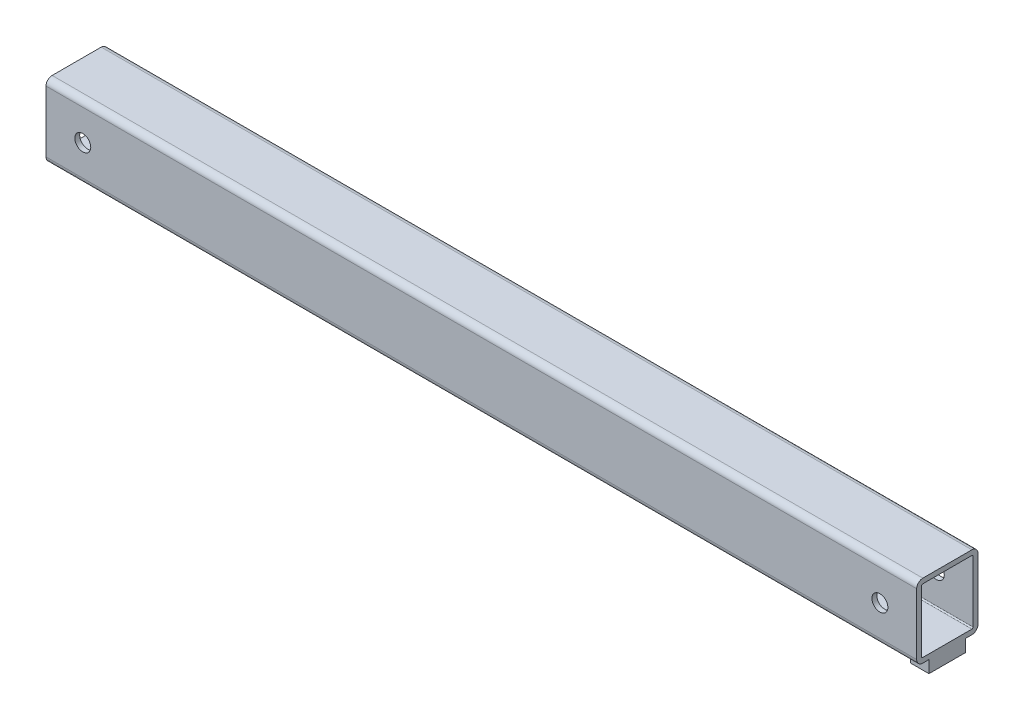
ISO-10303-21;
HEADER;
FILE_DESCRIPTION(('STEP AP214'),'2;1');
FILE_NAME('part.step','',(''),(''),'','','');
FILE_SCHEMA(('AUTOMOTIVE_DESIGN { 1 0 10303 214 1 1 1 1 }'));
ENDSEC;
DATA;
#1=APPLICATION_CONTEXT('core data for automotive mechanical design processes');
#2=APPLICATION_PROTOCOL_DEFINITION('international standard','automotive_design',2000,#1);
#3=PRODUCT_CONTEXT('',#1,'mechanical');
#4=PRODUCT('Part','Part','',(#3));
#5=PRODUCT_RELATED_PRODUCT_CATEGORY('part','',(#4));
#6=PRODUCT_DEFINITION_FORMATION('','',#4);
#7=PRODUCT_DEFINITION_CONTEXT('part definition',#1,'design');
#8=PRODUCT_DEFINITION('design','',#6,#7);
#9=PRODUCT_DEFINITION_SHAPE('','',#8);
#10=(LENGTH_UNIT() NAMED_UNIT(*) SI_UNIT(.MILLI.,.METRE.));
#11=(NAMED_UNIT(*) PLANE_ANGLE_UNIT() SI_UNIT($,.RADIAN.));
#12=(NAMED_UNIT(*) SI_UNIT($,.STERADIAN.) SOLID_ANGLE_UNIT());
#13=UNCERTAINTY_MEASURE_WITH_UNIT(LENGTH_MEASURE(1.E-05),#10,'distance_accuracy_value','');
#14=(GEOMETRIC_REPRESENTATION_CONTEXT(3) GLOBAL_UNCERTAINTY_ASSIGNED_CONTEXT((#13)) GLOBAL_UNIT_ASSIGNED_CONTEXT((#10,
#11,#12)) REPRESENTATION_CONTEXT('',''));
#15=CARTESIAN_POINT('',(0.,0.,0.));
#16=DIRECTION('',(0.,0.,1.));
#17=DIRECTION('',(1.,0.,0.));
#18=AXIS2_PLACEMENT_3D('',#15,#16,#17);
#19=CARTESIAN_POINT('',(680.,-25.0000000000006,-20.));
#20=DIRECTION('',(-1.,0.,0.));
#21=DIRECTION('',(0.,0.,1.));
#22=AXIS2_PLACEMENT_3D('',#19,#20,#21);
#23=CYLINDRICAL_SURFACE('',#22,1.);
#24=CARTESIAN_POINT('',(-29.9999999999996,-25.0000000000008,-20.));
#25=DIRECTION('',(-1.,0.,0.));
#26=DIRECTION('',(0.,0.,1.));
#27=AXIS2_PLACEMENT_3D('',#24,#25,#26);
#28=CIRCLE('',#27,1.);
#29=CARTESIAN_POINT('',(-30.,-26.0000000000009,-20.));
#30=VERTEX_POINT('',#29);
#31=CARTESIAN_POINT('',(-29.9999999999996,-25.0000000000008,-21.));
#32=VERTEX_POINT('',#31);
#33=EDGE_CURVE('E136',#30,#32,#28,.F.);
#34=ORIENTED_EDGE('',*,*,#33,.F.);
#35=DIRECTION('',(1.,0.,0.));
#36=VECTOR('',#35,1.);
#37=CARTESIAN_POINT('',(680.,-26.0000000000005,-19.9999999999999));
#38=LINE('',#37,#36);
#39=CARTESIAN_POINT('',(680.,-26.0000000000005,-20.));
#40=VERTEX_POINT('',#39);
#41=EDGE_CURVE('E138',#40,#30,#38,.F.);
#42=ORIENTED_EDGE('',*,*,#41,.F.);
#43=CARTESIAN_POINT('',(680.,-25.0000000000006,-20.));
#44=DIRECTION('',(-1.,0.,0.));
#45=DIRECTION('',(0.,0.,1.));
#46=AXIS2_PLACEMENT_3D('',#43,#44,#45);
#47=CIRCLE('',#46,1.);
#48=CARTESIAN_POINT('',(680.,-25.0000000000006,-21.));
#49=VERTEX_POINT('',#48);
#50=EDGE_CURVE('E19',#49,#40,#47,.T.);
#51=ORIENTED_EDGE('',*,*,#50,.F.);
#52=DIRECTION('',(1.,0.,0.));
#53=VECTOR('',#52,1.);
#54=CARTESIAN_POINT('',(680.,-25.0000000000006,-21.));
#55=LINE('',#54,#53);
#56=EDGE_CURVE('E143',#32,#49,#55,.T.);
#57=ORIENTED_EDGE('',*,*,#56,.F.);
#58=EDGE_LOOP('',(#34,#42,#51,#57));
#59=FACE_BOUND('',#58,.T.);
#60=ADVANCED_FACE('F15',(#59),#23,.F.);
#61=CARTESIAN_POINT('',(680.,-25.0000000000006,20.));
#62=DIRECTION('',(-1.,0.,0.));
#63=DIRECTION('',(0.,0.,1.));
#64=AXIS2_PLACEMENT_3D('',#61,#62,#63);
#65=CYLINDRICAL_SURFACE('',#64,1.);
#66=CARTESIAN_POINT('',(-29.9999999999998,-25.0000000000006,20.));
#67=DIRECTION('',(-1.,0.,0.));
#68=DIRECTION('',(0.,0.,1.));
#69=AXIS2_PLACEMENT_3D('',#66,#67,#68);
#70=CIRCLE('',#69,1.);
#71=CARTESIAN_POINT('',(-29.9999999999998,-25.0000000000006,21.));
#72=VERTEX_POINT('',#71);
#73=CARTESIAN_POINT('',(-30.,-26.0000000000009,20.));
#74=VERTEX_POINT('',#73);
#75=EDGE_CURVE('E337',#72,#74,#70,.F.);
#76=ORIENTED_EDGE('',*,*,#75,.F.);
#77=DIRECTION('',(1.,0.,0.));
#78=VECTOR('',#77,1.);
#79=CARTESIAN_POINT('',(680.,-25.0000000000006,21.));
#80=LINE('',#79,#78);
#81=CARTESIAN_POINT('',(680.,-25.0000000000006,21.));
#82=VERTEX_POINT('',#81);
#83=EDGE_CURVE('E232',#82,#72,#80,.F.);
#84=ORIENTED_EDGE('',*,*,#83,.F.);
#85=CARTESIAN_POINT('',(680.,-25.0000000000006,20.));
#86=DIRECTION('',(-1.,0.,0.));
#87=DIRECTION('',(0.,0.,1.));
#88=AXIS2_PLACEMENT_3D('',#85,#86,#87);
#89=CIRCLE('',#88,1.);
#90=CARTESIAN_POINT('',(680.,-26.0000000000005,20.));
#91=VERTEX_POINT('',#90);
#92=EDGE_CURVE('E339',#91,#82,#89,.T.);
#93=ORIENTED_EDGE('',*,*,#92,.F.);
#94=DIRECTION('',(1.,0.,0.));
#95=VECTOR('',#94,1.);
#96=CARTESIAN_POINT('',(680.,-26.0000000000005,20.));
#97=LINE('',#96,#95);
#98=EDGE_CURVE('E142',#74,#91,#97,.T.);
#99=ORIENTED_EDGE('',*,*,#98,.F.);
#100=EDGE_LOOP('',(#76,#84,#93,#99));
#101=FACE_BOUND('',#100,.T.);
#102=ADVANCED_FACE('F365',(#101),#65,.F.);
#103=CARTESIAN_POINT('',(680.,24.9999999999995,20.));
#104=DIRECTION('',(-1.,0.,0.));
#105=DIRECTION('',(0.,0.,1.));
#106=AXIS2_PLACEMENT_3D('',#103,#104,#105);
#107=CYLINDRICAL_SURFACE('',#106,0.999999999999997);
#108=CARTESIAN_POINT('',(-30.,24.9999999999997,20.));
#109=DIRECTION('',(-1.,0.,0.));
#110=DIRECTION('',(0.,0.,1.));
#111=AXIS2_PLACEMENT_3D('',#108,#109,#110);
#112=CIRCLE('',#111,0.999999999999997);
#113=CARTESIAN_POINT('',(-30.,25.9999999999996,19.9999999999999));
#114=VERTEX_POINT('',#113);
#115=CARTESIAN_POINT('',(-29.9999999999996,24.9999999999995,21.));
#116=VERTEX_POINT('',#115);
#117=EDGE_CURVE('E333',#114,#116,#112,.F.);
#118=ORIENTED_EDGE('',*,*,#117,.F.);
#119=DIRECTION('',(1.,0.,0.));
#120=VECTOR('',#119,1.);
#121=CARTESIAN_POINT('',(680.,25.9999999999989,19.9999999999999));
#122=LINE('',#121,#120);
#123=CARTESIAN_POINT('',(680.,25.9999999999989,20.));
#124=VERTEX_POINT('',#123);
#125=EDGE_CURVE('E224',#124,#114,#122,.F.);
#126=ORIENTED_EDGE('',*,*,#125,.F.);
#127=CARTESIAN_POINT('',(680.,24.9999999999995,20.));
#128=DIRECTION('',(-1.,0.,0.));
#129=DIRECTION('',(0.,0.,1.));
#130=AXIS2_PLACEMENT_3D('',#127,#128,#129);
#131=CIRCLE('',#130,0.999999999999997);
#132=CARTESIAN_POINT('',(680.,24.9999999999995,21.));
#133=VERTEX_POINT('',#132);
#134=EDGE_CURVE('E335',#133,#124,#131,.T.);
#135=ORIENTED_EDGE('',*,*,#134,.F.);
#136=DIRECTION('',(1.,0.,0.));
#137=VECTOR('',#136,1.);
#138=CARTESIAN_POINT('',(680.,24.9999999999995,21.));
#139=LINE('',#138,#137);
#140=EDGE_CURVE('E228',#116,#133,#139,.T.);
#141=ORIENTED_EDGE('',*,*,#140,.F.);
#142=EDGE_LOOP('',(#118,#126,#135,#141));
#143=FACE_BOUND('',#142,.T.);
#144=ADVANCED_FACE('F358',(#143),#107,.F.);
#145=CARTESIAN_POINT('',(680.,24.9999999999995,-20.));
#146=DIRECTION('',(-1.,0.,0.));
#147=DIRECTION('',(0.,0.,1.));
#148=AXIS2_PLACEMENT_3D('',#145,#146,#147);
#149=CYLINDRICAL_SURFACE('',#148,0.999999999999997);
#150=CARTESIAN_POINT('',(-30.,24.9999999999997,-20.));
#151=DIRECTION('',(-1.,0.,0.));
#152=DIRECTION('',(0.,0.,1.));
#153=AXIS2_PLACEMENT_3D('',#150,#151,#152);
#154=CIRCLE('',#153,0.999999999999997);
#155=CARTESIAN_POINT('',(-29.9999999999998,24.9999999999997,-21.));
#156=VERTEX_POINT('',#155);
#157=CARTESIAN_POINT('',(-30.,25.9999999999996,-20.));
#158=VERTEX_POINT('',#157);
#159=EDGE_CURVE('E291',#156,#158,#154,.F.);
#160=ORIENTED_EDGE('',*,*,#159,.F.);
#161=DIRECTION('',(1.,0.,0.));
#162=VECTOR('',#161,1.);
#163=CARTESIAN_POINT('',(680.,24.9999999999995,-21.));
#164=LINE('',#163,#162);
#165=CARTESIAN_POINT('',(680.,24.9999999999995,-21.));
#166=VERTEX_POINT('',#165);
#167=EDGE_CURVE('E240',#166,#156,#164,.F.);
#168=ORIENTED_EDGE('',*,*,#167,.F.);
#169=CARTESIAN_POINT('',(680.,24.9999999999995,-20.));
#170=DIRECTION('',(-1.,0.,0.));
#171=DIRECTION('',(0.,0.,1.));
#172=AXIS2_PLACEMENT_3D('',#169,#170,#171);
#173=CIRCLE('',#172,0.999999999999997);
#174=CARTESIAN_POINT('',(680.,25.9999999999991,-20.));
#175=VERTEX_POINT('',#174);
#176=EDGE_CURVE('E331',#175,#166,#173,.T.);
#177=ORIENTED_EDGE('',*,*,#176,.F.);
#178=DIRECTION('',(1.,0.,0.));
#179=VECTOR('',#178,1.);
#180=CARTESIAN_POINT('',(680.,25.9999999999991,-20.));
#181=LINE('',#180,#179);
#182=EDGE_CURVE('E227',#158,#175,#181,.T.);
#183=ORIENTED_EDGE('',*,*,#182,.F.);
#184=EDGE_LOOP('',(#160,#168,#177,#183));
#185=FACE_BOUND('',#184,.T.);
#186=ADVANCED_FACE('F348',(#185),#149,.F.);
#187=CARTESIAN_POINT('',(650.,-4.44089209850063E-13,-25.));
#188=DIRECTION('',(0.,0.,1.));
#189=DIRECTION('',(1.,0.,0.));
#190=AXIS2_PLACEMENT_3D('',#187,#188,#189);
#191=CYLINDRICAL_SURFACE('',#190,6.49999999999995);
#192=CARTESIAN_POINT('',(650.,-6.66133814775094E-13,21.));
#193=DIRECTION('',(0.,0.,1.));
#194=DIRECTION('',(1.,0.,0.));
#195=AXIS2_PLACEMENT_3D('',#192,#193,#194);
#196=CIRCLE('',#195,6.49999999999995);
#197=CARTESIAN_POINT('',(656.5,-4.44089209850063E-13,21.));
#198=VERTEX_POINT('',#197);
#199=EDGE_CURVE('E239',#198,#198,#196,.T.);
#200=CARTESIAN_POINT('',(650.,-6.66133814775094E-13,25.));
#201=DIRECTION('',(0.,0.,1.));
#202=DIRECTION('',(1.,0.,0.));
#203=AXIS2_PLACEMENT_3D('',#200,#201,#202);
#204=CIRCLE('',#203,6.49999999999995);
#205=CARTESIAN_POINT('',(656.5,-4.44089209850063E-13,25.));
#206=VERTEX_POINT('',#205);
#207=EDGE_CURVE('E231',#206,#206,#204,.T.);
#208=CARTESIAN_POINT('',(656.5,-4.44089209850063E-13,21.));
#209=CARTESIAN_POINT('',(656.5,-4.44089209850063E-13,21.0416666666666));
#210=CARTESIAN_POINT('',(656.5,-4.44089209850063E-13,21.0833333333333));
#211=CARTESIAN_POINT('',(656.5,-4.44089209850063E-13,21.1666666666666));
#212=CARTESIAN_POINT('',(656.5,-4.44089209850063E-13,21.2083333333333));
#213=CARTESIAN_POINT('',(656.5,-4.44089209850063E-13,21.2916666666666));
#214=CARTESIAN_POINT('',(656.5,-4.44089209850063E-13,21.3333333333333));
#215=CARTESIAN_POINT('',(656.5,-4.44089209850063E-13,21.4166666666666));
#216=CARTESIAN_POINT('',(656.5,-4.44089209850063E-13,21.4583333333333));
#217=CARTESIAN_POINT('',(656.5,-4.44089209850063E-13,21.5416666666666));
#218=CARTESIAN_POINT('',(656.5,-4.44089209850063E-13,21.5833333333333));
#219=CARTESIAN_POINT('',(656.5,-4.44089209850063E-13,21.6666666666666));
#220=CARTESIAN_POINT('',(656.5,-4.44089209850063E-13,21.7083333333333));
#221=CARTESIAN_POINT('',(656.5,-4.44089209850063E-13,21.7916666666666));
#222=CARTESIAN_POINT('',(656.5,-4.44089209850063E-13,21.8333333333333));
#223=CARTESIAN_POINT('',(656.5,-4.44089209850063E-13,21.9166666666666));
#224=CARTESIAN_POINT('',(656.5,-4.44089209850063E-13,21.9583333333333));
#225=CARTESIAN_POINT('',(656.5,-4.44089209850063E-13,22.0416666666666));
#226=CARTESIAN_POINT('',(656.5,-4.44089209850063E-13,22.0833333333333));
#227=CARTESIAN_POINT('',(656.5,-4.44089209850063E-13,22.1666666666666));
#228=CARTESIAN_POINT('',(656.5,-4.44089209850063E-13,22.2083333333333));
#229=CARTESIAN_POINT('',(656.5,-4.44089209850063E-13,22.2916666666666));
#230=CARTESIAN_POINT('',(656.5,-4.44089209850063E-13,22.3333333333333));
#231=CARTESIAN_POINT('',(656.5,-4.44089209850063E-13,22.4166666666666));
#232=CARTESIAN_POINT('',(656.5,-4.44089209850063E-13,22.4583333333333));
#233=CARTESIAN_POINT('',(656.5,-4.44089209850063E-13,22.5416666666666));
#234=CARTESIAN_POINT('',(656.5,-4.44089209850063E-13,22.5833333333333));
#235=CARTESIAN_POINT('',(656.5,-4.44089209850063E-13,22.6666666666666));
#236=CARTESIAN_POINT('',(656.5,-4.44089209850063E-13,22.7083333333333));
#237=CARTESIAN_POINT('',(656.5,-4.44089209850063E-13,22.7916666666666));
#238=CARTESIAN_POINT('',(656.5,-4.44089209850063E-13,22.8333333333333));
#239=CARTESIAN_POINT('',(656.5,-4.44089209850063E-13,22.9166666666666));
#240=CARTESIAN_POINT('',(656.5,-4.44089209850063E-13,22.9583333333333));
#241=CARTESIAN_POINT('',(656.5,-4.44089209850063E-13,23.0416666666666));
#242=CARTESIAN_POINT('',(656.5,-4.44089209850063E-13,23.0833333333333));
#243=CARTESIAN_POINT('',(656.5,-4.44089209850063E-13,23.1666666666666));
#244=CARTESIAN_POINT('',(656.5,-4.44089209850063E-13,23.2083333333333));
#245=CARTESIAN_POINT('',(656.5,-4.44089209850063E-13,23.2916666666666));
#246=CARTESIAN_POINT('',(656.5,-4.44089209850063E-13,23.3333333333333));
#247=CARTESIAN_POINT('',(656.5,-4.44089209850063E-13,23.4166666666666));
#248=CARTESIAN_POINT('',(656.5,-4.44089209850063E-13,23.4583333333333));
#249=CARTESIAN_POINT('',(656.5,-4.44089209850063E-13,23.5416666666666));
#250=CARTESIAN_POINT('',(656.5,-4.44089209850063E-13,23.5833333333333));
#251=CARTESIAN_POINT('',(656.5,-4.44089209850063E-13,23.6666666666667));
#252=CARTESIAN_POINT('',(656.5,-4.44089209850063E-13,23.7083333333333));
#253=CARTESIAN_POINT('',(656.5,-4.44089209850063E-13,23.7916666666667));
#254=CARTESIAN_POINT('',(656.5,-4.44089209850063E-13,23.8333333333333));
#255=CARTESIAN_POINT('',(656.5,-4.44089209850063E-13,23.9166666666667));
#256=CARTESIAN_POINT('',(656.5,-4.44089209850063E-13,23.9583333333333));
#257=CARTESIAN_POINT('',(656.5,-4.44089209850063E-13,24.0416666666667));
#258=CARTESIAN_POINT('',(656.5,-4.44089209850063E-13,24.0833333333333));
#259=CARTESIAN_POINT('',(656.5,-4.44089209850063E-13,24.1666666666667));
#260=CARTESIAN_POINT('',(656.5,-4.44089209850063E-13,24.2083333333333));
#261=CARTESIAN_POINT('',(656.5,-4.44089209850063E-13,24.2916666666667));
#262=CARTESIAN_POINT('',(656.5,-4.44089209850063E-13,24.3333333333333));
#263=CARTESIAN_POINT('',(656.5,-4.44089209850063E-13,24.4166666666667));
#264=CARTESIAN_POINT('',(656.5,-4.44089209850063E-13,24.4583333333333));
#265=CARTESIAN_POINT('',(656.5,-4.44089209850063E-13,24.5416666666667));
#266=CARTESIAN_POINT('',(656.5,-4.44089209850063E-13,24.5833333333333));
#267=CARTESIAN_POINT('',(656.5,-4.44089209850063E-13,24.6666666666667));
#268=CARTESIAN_POINT('',(656.5,-4.44089209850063E-13,24.7083333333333));
#269=CARTESIAN_POINT('',(656.5,-4.44089209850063E-13,24.7916666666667));
#270=CARTESIAN_POINT('',(656.5,-4.44089209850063E-13,24.8333333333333));
#271=CARTESIAN_POINT('',(656.5,-4.44089209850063E-13,24.9166666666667));
#272=CARTESIAN_POINT('',(656.5,-4.44089209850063E-13,24.9583333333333));
#273=CARTESIAN_POINT('',(656.5,-4.44089209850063E-13,25.));
#274=B_SPLINE_CURVE_WITH_KNOTS('',3,(#208,#209,#210,#211,#212,#213,#214,#215,#216,#217,#218,
#219,#220,#221,#222,#223,#224,#225,#226,#227,#228,#229,#230,#231,#232,#233,#234,#235,#236,#237,
#238,#239,#240,#241,#242,#243,#244,#245,#246,#247,#248,#249,#250,#251,#252,#253,#254,#255,#256,
#257,#258,#259,#260,#261,#262,#263,#264,#265,#266,#267,#268,#269,#270,#271,#272,#273),
.UNSPECIFIED.,.F.,.F.,(4,2,2,2,2,2,2,2,2,2,2,2,2,2,2,2,2,2,2,2,2,2,2,2,2,2,2,2,2,2,2,2,4),(0.,
0.125,0.25,0.375,0.5,0.625000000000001,0.750000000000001,0.875000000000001,1.,1.125,1.25,1.375,
1.5,1.625,1.75,1.875,2.,2.125,2.25,2.375,2.5,2.625,2.75,2.875,3.,3.125,3.25,3.375,3.5,3.625,
3.75,3.875,4.),.UNSPECIFIED.);
#275=EDGE_CURVE('BSEAM500',#198,#206,#274,.T.);
#276=ORIENTED_EDGE('',*,*,#199,.F.);
#277=ORIENTED_EDGE('',*,*,#207,.T.);
#278=ORIENTED_EDGE('',*,*,#275,.T.);
#279=ORIENTED_EDGE('',*,*,#275,.F.);
#280=EDGE_LOOP('',(#276,#278,#277,#279));
#281=FACE_BOUND('',#280,.T.);
#282=ADVANCED_FACE('F500',(#281),#191,.F.);
#283=CARTESIAN_POINT('',(0.,0.,-25.));
#284=DIRECTION('',(0.,0.,1.));
#285=DIRECTION('',(1.,0.,0.));
#286=AXIS2_PLACEMENT_3D('',#283,#284,#285);
#287=CYLINDRICAL_SURFACE('',#286,6.5);
#288=CARTESIAN_POINT('',(0.,0.,21.));
#289=DIRECTION('',(0.,0.,1.));
#290=DIRECTION('',(1.,0.,0.));
#291=AXIS2_PLACEMENT_3D('',#288,#289,#290);
#292=CIRCLE('',#291,6.5);
#293=CARTESIAN_POINT('',(6.5,0.,21.));
#294=VERTEX_POINT('',#293);
#295=EDGE_CURVE('E235',#294,#294,#292,.T.);
#296=CARTESIAN_POINT('',(0.,0.,25.));
#297=DIRECTION('',(0.,0.,1.));
#298=DIRECTION('',(1.,0.,0.));
#299=AXIS2_PLACEMENT_3D('',#296,#297,#298);
#300=CIRCLE('',#299,6.5);
#301=CARTESIAN_POINT('',(6.5,0.,25.));
#302=VERTEX_POINT('',#301);
#303=EDGE_CURVE('E223',#302,#302,#300,.T.);
#304=CARTESIAN_POINT('',(6.5,0.,21.));
#305=CARTESIAN_POINT('',(6.5,0.,21.0416666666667));
#306=CARTESIAN_POINT('',(6.5,0.,21.0833333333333));
#307=CARTESIAN_POINT('',(6.5,0.,21.1666666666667));
#308=CARTESIAN_POINT('',(6.5,0.,21.2083333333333));
#309=CARTESIAN_POINT('',(6.5,0.,21.2916666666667));
#310=CARTESIAN_POINT('',(6.5,0.,21.3333333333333));
#311=CARTESIAN_POINT('',(6.5,0.,21.4166666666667));
#312=CARTESIAN_POINT('',(6.5,0.,21.4583333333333));
#313=CARTESIAN_POINT('',(6.5,0.,21.5416666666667));
#314=CARTESIAN_POINT('',(6.5,0.,21.5833333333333));
#315=CARTESIAN_POINT('',(6.5,0.,21.6666666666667));
#316=CARTESIAN_POINT('',(6.5,0.,21.7083333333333));
#317=CARTESIAN_POINT('',(6.5,0.,21.7916666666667));
#318=CARTESIAN_POINT('',(6.5,0.,21.8333333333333));
#319=CARTESIAN_POINT('',(6.5,0.,21.9166666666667));
#320=CARTESIAN_POINT('',(6.5,0.,21.9583333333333));
#321=CARTESIAN_POINT('',(6.5,0.,22.0416666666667));
#322=CARTESIAN_POINT('',(6.5,0.,22.0833333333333));
#323=CARTESIAN_POINT('',(6.5,0.,22.1666666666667));
#324=CARTESIAN_POINT('',(6.5,0.,22.2083333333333));
#325=CARTESIAN_POINT('',(6.5,0.,22.2916666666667));
#326=CARTESIAN_POINT('',(6.5,0.,22.3333333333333));
#327=CARTESIAN_POINT('',(6.5,0.,22.4166666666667));
#328=CARTESIAN_POINT('',(6.5,0.,22.4583333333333));
#329=CARTESIAN_POINT('',(6.5,0.,22.5416666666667));
#330=CARTESIAN_POINT('',(6.5,0.,22.5833333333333));
#331=CARTESIAN_POINT('',(6.5,0.,22.6666666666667));
#332=CARTESIAN_POINT('',(6.5,0.,22.7083333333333));
#333=CARTESIAN_POINT('',(6.5,0.,22.7916666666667));
#334=CARTESIAN_POINT('',(6.5,0.,22.8333333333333));
#335=CARTESIAN_POINT('',(6.5,0.,22.9166666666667));
#336=CARTESIAN_POINT('',(6.5,0.,22.9583333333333));
#337=CARTESIAN_POINT('',(6.5,0.,23.0416666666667));
#338=CARTESIAN_POINT('',(6.5,0.,23.0833333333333));
#339=CARTESIAN_POINT('',(6.5,0.,23.1666666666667));
#340=CARTESIAN_POINT('',(6.5,0.,23.2083333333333));
#341=CARTESIAN_POINT('',(6.5,0.,23.2916666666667));
#342=CARTESIAN_POINT('',(6.5,0.,23.3333333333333));
#343=CARTESIAN_POINT('',(6.5,0.,23.4166666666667));
#344=CARTESIAN_POINT('',(6.5,0.,23.4583333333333));
#345=CARTESIAN_POINT('',(6.5,0.,23.5416666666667));
#346=CARTESIAN_POINT('',(6.5,0.,23.5833333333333));
#347=CARTESIAN_POINT('',(6.5,0.,23.6666666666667));
#348=CARTESIAN_POINT('',(6.5,0.,23.7083333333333));
#349=CARTESIAN_POINT('',(6.5,0.,23.7916666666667));
#350=CARTESIAN_POINT('',(6.5,0.,23.8333333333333));
#351=CARTESIAN_POINT('',(6.5,0.,23.9166666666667));
#352=CARTESIAN_POINT('',(6.5,0.,23.9583333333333));
#353=CARTESIAN_POINT('',(6.5,0.,24.0416666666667));
#354=CARTESIAN_POINT('',(6.5,0.,24.0833333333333));
#355=CARTESIAN_POINT('',(6.5,0.,24.1666666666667));
#356=CARTESIAN_POINT('',(6.5,0.,24.2083333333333));
#357=CARTESIAN_POINT('',(6.5,0.,24.2916666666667));
#358=CARTESIAN_POINT('',(6.5,0.,24.3333333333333));
#359=CARTESIAN_POINT('',(6.5,0.,24.4166666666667));
#360=CARTESIAN_POINT('',(6.5,0.,24.4583333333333));
#361=CARTESIAN_POINT('',(6.5,0.,24.5416666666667));
#362=CARTESIAN_POINT('',(6.5,0.,24.5833333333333));
#363=CARTESIAN_POINT('',(6.5,0.,24.6666666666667));
#364=CARTESIAN_POINT('',(6.5,0.,24.7083333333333));
#365=CARTESIAN_POINT('',(6.5,0.,24.7916666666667));
#366=CARTESIAN_POINT('',(6.5,0.,24.8333333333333));
#367=CARTESIAN_POINT('',(6.5,0.,24.9166666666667));
#368=CARTESIAN_POINT('',(6.5,0.,24.9583333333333));
#369=CARTESIAN_POINT('',(6.5,0.,25.));
#370=B_SPLINE_CURVE_WITH_KNOTS('',3,(#304,#305,#306,#307,#308,#309,#310,#311,#312,#313,#314,
#315,#316,#317,#318,#319,#320,#321,#322,#323,#324,#325,#326,#327,#328,#329,#330,#331,#332,#333,
#334,#335,#336,#337,#338,#339,#340,#341,#342,#343,#344,#345,#346,#347,#348,#349,#350,#351,#352,
#353,#354,#355,#356,#357,#358,#359,#360,#361,#362,#363,#364,#365,#366,#367,#368,#369),
.UNSPECIFIED.,.F.,.F.,(4,2,2,2,2,2,2,2,2,2,2,2,2,2,2,2,2,2,2,2,2,2,2,2,2,2,2,2,2,2,2,2,4),(0.,
0.125,0.25,0.375,0.5,0.625000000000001,0.750000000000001,0.875000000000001,1.,1.125,1.25,1.375,
1.5,1.625,1.75,1.875,2.,2.125,2.25,2.375,2.5,2.625,2.75,2.875,3.,3.125,3.25,3.375,3.5,3.625,
3.75,3.875,4.),.UNSPECIFIED.);
#371=EDGE_CURVE('BSEAM493',#294,#302,#370,.T.);
#372=ORIENTED_EDGE('',*,*,#295,.F.);
#373=ORIENTED_EDGE('',*,*,#303,.T.);
#374=ORIENTED_EDGE('',*,*,#371,.T.);
#375=ORIENTED_EDGE('',*,*,#371,.F.);
#376=EDGE_LOOP('',(#372,#374,#373,#375));
#377=FACE_BOUND('',#376,.T.);
#378=ADVANCED_FACE('F493',(#377),#287,.F.);
#379=CARTESIAN_POINT('',(665.,-40.0000000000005,15.));
#380=DIRECTION('',(1.,0.,0.));
#381=DIRECTION('',(0.,0.,-1.));
#382=AXIS2_PLACEMENT_3D('',#379,#380,#381);
#383=PLANE('',#382);
#384=DIRECTION('',(0.,1.,0.));
#385=VECTOR('',#384,1.);
#386=CARTESIAN_POINT('',(665.,-40.0000000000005,-15.));
#387=LINE('',#386,#385);
#388=CARTESIAN_POINT('',(665.,-30.0000000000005,-15.));
#389=VERTEX_POINT('',#388);
#390=CARTESIAN_POINT('',(665.,-40.0000000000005,-15.));
#391=VERTEX_POINT('',#390);
#392=EDGE_CURVE('E259',#389,#391,#387,.F.);
#393=ORIENTED_EDGE('',*,*,#392,.T.);
#394=DIRECTION('',(0.,0.,-1.));
#395=VECTOR('',#394,1.);
#396=CARTESIAN_POINT('',(665.,-40.0000000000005,15.));
#397=LINE('',#396,#395);
#398=CARTESIAN_POINT('',(665.,-40.0000000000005,15.));
#399=VERTEX_POINT('',#398);
#400=EDGE_CURVE('E269',#399,#391,#397,.T.);
#401=ORIENTED_EDGE('',*,*,#400,.F.);
#402=DIRECTION('',(0.,1.,0.));
#403=VECTOR('',#402,1.);
#404=CARTESIAN_POINT('',(665.,-40.0000000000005,15.));
#405=LINE('',#404,#403);
#406=CARTESIAN_POINT('',(665.,-30.0000000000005,15.));
#407=VERTEX_POINT('',#406);
#408=EDGE_CURVE('E288',#399,#407,#405,.T.);
#409=ORIENTED_EDGE('',*,*,#408,.T.);
#410=DIRECTION('',(0.,0.,1.));
#411=VECTOR('',#410,1.);
#412=CARTESIAN_POINT('',(665.,-30.0000000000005,20.));
#413=LINE('',#412,#411);
#414=EDGE_CURVE('E249',#407,#389,#413,.F.);
#415=ORIENTED_EDGE('',*,*,#414,.T.);
#416=EDGE_LOOP('',(#393,#401,#409,#415));
#417=FACE_BOUND('',#416,.T.);
#418=ADVANCED_FACE('F491',(#417),#383,.F.);
#419=CARTESIAN_POINT('',(665.,-40.0000000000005,15.));
#420=DIRECTION('',(0.,0.,-1.));
#421=DIRECTION('',(-1.,0.,0.));
#422=AXIS2_PLACEMENT_3D('',#419,#420,#421);
#423=PLANE('',#422);
#424=ORIENTED_EDGE('',*,*,#408,.F.);
#425=DIRECTION('',(1.,0.,0.));
#426=VECTOR('',#425,1.);
#427=CARTESIAN_POINT('',(665.,-40.0000000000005,15.));
#428=LINE('',#427,#426);
#429=CARTESIAN_POINT('',(680.,-40.0000000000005,15.));
#430=VERTEX_POINT('',#429);
#431=EDGE_CURVE('E266',#430,#399,#428,.F.);
#432=ORIENTED_EDGE('',*,*,#431,.F.);
#433=DIRECTION('',(0.,1.,0.));
#434=VECTOR('',#433,1.);
#435=CARTESIAN_POINT('',(680.,24.9999999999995,15.));
#436=LINE('',#435,#434);
#437=CARTESIAN_POINT('',(680.,-30.0000000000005,15.));
#438=VERTEX_POINT('',#437);
#439=EDGE_CURVE('E172',#438,#430,#436,.F.);
#440=ORIENTED_EDGE('',*,*,#439,.F.);
#441=DIRECTION('',(1.,0.,0.));
#442=VECTOR('',#441,1.);
#443=CARTESIAN_POINT('',(680.,-30.0000000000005,15.));
#444=LINE('',#443,#442);
#445=EDGE_CURVE('E221',#438,#407,#444,.F.);
#446=ORIENTED_EDGE('',*,*,#445,.T.);
#447=EDGE_LOOP('',(#424,#432,#440,#446));
#448=FACE_BOUND('',#447,.T.);
#449=ADVANCED_FACE('F487',(#448),#423,.F.);
#450=CARTESIAN_POINT('',(665.,-40.0000000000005,15.));
#451=DIRECTION('',(0.,-1.,0.));
#452=DIRECTION('',(0.,0.,-1.));
#453=AXIS2_PLACEMENT_3D('',#450,#451,#452);
#454=PLANE('',#453);
#455=DIRECTION('',(0.,0.,-1.));
#456=VECTOR('',#455,1.);
#457=CARTESIAN_POINT('',(680.,-40.0000000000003,20.));
#458=LINE('',#457,#456);
#459=CARTESIAN_POINT('',(680.,-40.0000000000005,-15.));
#460=VERTEX_POINT('',#459);
#461=EDGE_CURVE('E254',#430,#460,#458,.T.);
#462=ORIENTED_EDGE('',*,*,#461,.F.);
#463=ORIENTED_EDGE('',*,*,#431,.T.);
#464=ORIENTED_EDGE('',*,*,#400,.T.);
#465=DIRECTION('',(1.,0.,0.));
#466=VECTOR('',#465,1.);
#467=CARTESIAN_POINT('',(665.,-40.0000000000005,-15.));
#468=LINE('',#467,#466);
#469=EDGE_CURVE('E243',#391,#460,#468,.T.);
#470=ORIENTED_EDGE('',*,*,#469,.T.);
#471=EDGE_LOOP('',(#462,#463,#464,#470));
#472=FACE_BOUND('',#471,.T.);
#473=ADVANCED_FACE('F404',(#472),#454,.T.);
#474=CARTESIAN_POINT('',(665.,-40.0000000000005,-15.));
#475=DIRECTION('',(0.,0.,1.));
#476=DIRECTION('',(1.,0.,0.));
#477=AXIS2_PLACEMENT_3D('',#474,#475,#476);
#478=PLANE('',#477);
#479=DIRECTION('',(0.,1.,0.));
#480=VECTOR('',#479,1.);
#481=CARTESIAN_POINT('',(680.,24.9999999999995,-15.));
#482=LINE('',#481,#480);
#483=CARTESIAN_POINT('',(680.,-30.0000000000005,-15.));
#484=VERTEX_POINT('',#483);
#485=EDGE_CURVE('E166',#460,#484,#482,.T.);
#486=ORIENTED_EDGE('',*,*,#485,.F.);
#487=ORIENTED_EDGE('',*,*,#469,.F.);
#488=ORIENTED_EDGE('',*,*,#392,.F.);
#489=DIRECTION('',(1.,0.,0.));
#490=VECTOR('',#489,1.);
#491=CARTESIAN_POINT('',(680.,-30.0000000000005,-15.));
#492=LINE('',#491,#490);
#493=EDGE_CURVE('E245',#389,#484,#492,.T.);
#494=ORIENTED_EDGE('',*,*,#493,.T.);
#495=EDGE_LOOP('',(#486,#487,#488,#494));
#496=FACE_BOUND('',#495,.T.);
#497=ADVANCED_FACE('F397',(#496),#478,.F.);
#498=CARTESIAN_POINT('',(680.,24.9999999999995,-21.));
#499=DIRECTION('',(0.,0.,1.));
#500=DIRECTION('',(0.,-1.,0.));
#501=AXIS2_PLACEMENT_3D('',#498,#499,#500);
#502=PLANE('',#501);
#503=ORIENTED_EDGE('',*,*,#56,.T.);
#504=DIRECTION('',(0.,1.,0.));
#505=VECTOR('',#504,1.);
#506=CARTESIAN_POINT('',(680.,24.9999999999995,-21.));
#507=LINE('',#506,#505);
#508=EDGE_CURVE('E135',#166,#49,#507,.F.);
#509=ORIENTED_EDGE('',*,*,#508,.F.);
#510=ORIENTED_EDGE('',*,*,#167,.T.);
#511=DIRECTION('',(0.,1.,0.));
#512=VECTOR('',#511,1.);
#513=CARTESIAN_POINT('',(-29.9999999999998,24.9999999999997,-21.));
#514=LINE('',#513,#512);
#515=EDGE_CURVE('E199',#156,#32,#514,.F.);
#516=ORIENTED_EDGE('',*,*,#515,.T.);
#517=EDGE_LOOP('',(#503,#509,#510,#516));
#518=FACE_BOUND('',#517,.T.);
#519=CARTESIAN_POINT('',(0.,0.,-21.));
#520=DIRECTION('',(0.,0.,1.));
#521=DIRECTION('',(1.,0.,0.));
#522=AXIS2_PLACEMENT_3D('',#519,#520,#521);
#523=CIRCLE('',#522,6.5);
#524=CARTESIAN_POINT('',(6.5,0.,-21.));
#525=VERTEX_POINT('',#524);
#526=EDGE_CURVE('E317',#525,#525,#523,.F.);
#527=ORIENTED_EDGE('',*,*,#526,.T.);
#528=EDGE_LOOP('',(#527));
#529=FACE_BOUND('',#528,.T.);
#530=CARTESIAN_POINT('',(650.,-4.44089209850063E-13,-21.));
#531=DIRECTION('',(0.,0.,1.));
#532=DIRECTION('',(1.,0.,0.));
#533=AXIS2_PLACEMENT_3D('',#530,#531,#532);
#534=CIRCLE('',#533,6.49999999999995);
#535=CARTESIAN_POINT('',(656.5,-4.44089209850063E-13,-21.));
#536=VERTEX_POINT('',#535);
#537=EDGE_CURVE('E248',#536,#536,#534,.F.);
#538=ORIENTED_EDGE('',*,*,#537,.T.);
#539=EDGE_LOOP('',(#538));
#540=FACE_BOUND('',#539,.T.);
#541=ADVANCED_FACE('F344',(#518,#529,#540),#502,.T.);
#542=CARTESIAN_POINT('',(680.,-26.0000000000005,20.));
#543=DIRECTION('',(0.,1.,0.));
#544=DIRECTION('',(0.,0.,1.));
#545=AXIS2_PLACEMENT_3D('',#542,#543,#544);
#546=PLANE('',#545);
#547=ORIENTED_EDGE('',*,*,#98,.T.);
#548=DIRECTION('',(0.,0.,-1.));
#549=VECTOR('',#548,1.);
#550=CARTESIAN_POINT('',(680.,-26.0000000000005,20.));
#551=LINE('',#550,#549);
#552=EDGE_CURVE('E133',#40,#91,#551,.F.);
#553=ORIENTED_EDGE('',*,*,#552,.F.);
#554=ORIENTED_EDGE('',*,*,#41,.T.);
#555=DIRECTION('',(0.,0.,-1.));
#556=VECTOR('',#555,1.);
#557=CARTESIAN_POINT('',(-30.,-26.0000000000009,20.));
#558=LINE('',#557,#556);
#559=EDGE_CURVE('E197',#30,#74,#558,.F.);
#560=ORIENTED_EDGE('',*,*,#559,.T.);
#561=EDGE_LOOP('',(#547,#553,#554,#560));
#562=FACE_BOUND('',#561,.T.);
#563=ADVANCED_FACE('F146',(#562),#546,.T.);
#564=CARTESIAN_POINT('',(680.,24.9999999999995,21.));
#565=DIRECTION('',(0.,0.,-1.));
#566=DIRECTION('',(0.,1.,0.));
#567=AXIS2_PLACEMENT_3D('',#564,#565,#566);
#568=PLANE('',#567);
#569=ORIENTED_EDGE('',*,*,#140,.T.);
#570=DIRECTION('',(0.,1.,0.));
#571=VECTOR('',#570,1.);
#572=CARTESIAN_POINT('',(680.,24.9999999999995,21.));
#573=LINE('',#572,#571);
#574=EDGE_CURVE('E157',#82,#133,#573,.T.);
#575=ORIENTED_EDGE('',*,*,#574,.F.);
#576=ORIENTED_EDGE('',*,*,#83,.T.);
#577=DIRECTION('',(0.,1.,0.));
#578=VECTOR('',#577,1.);
#579=CARTESIAN_POINT('',(-29.9999999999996,24.9999999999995,21.));
#580=LINE('',#579,#578);
#581=EDGE_CURVE('E194',#72,#116,#580,.T.);
#582=ORIENTED_EDGE('',*,*,#581,.T.);
#583=EDGE_LOOP('',(#569,#575,#576,#582));
#584=FACE_BOUND('',#583,.T.);
#585=ORIENTED_EDGE('',*,*,#295,.T.);
#586=EDGE_LOOP('',(#585));
#587=FACE_BOUND('',#586,.T.);
#588=ORIENTED_EDGE('',*,*,#199,.T.);
#589=EDGE_LOOP('',(#588));
#590=FACE_BOUND('',#589,.T.);
#591=ADVANCED_FACE('F361',(#584,#587,#590),#568,.T.);
#592=CARTESIAN_POINT('',(680.,25.9999999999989,20.));
#593=DIRECTION('',(0.,-1.,0.));
#594=DIRECTION('',(0.,0.,-1.));
#595=AXIS2_PLACEMENT_3D('',#592,#593,#594);
#596=PLANE('',#595);
#597=ORIENTED_EDGE('',*,*,#182,.T.);
#598=DIRECTION('',(0.,0.,-1.));
#599=VECTOR('',#598,1.);
#600=CARTESIAN_POINT('',(680.,25.9999999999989,20.));
#601=LINE('',#600,#599);
#602=EDGE_CURVE('E152',#124,#175,#601,.T.);
#603=ORIENTED_EDGE('',*,*,#602,.F.);
#604=ORIENTED_EDGE('',*,*,#125,.T.);
#605=DIRECTION('',(0.,0.,-1.));
#606=VECTOR('',#605,1.);
#607=CARTESIAN_POINT('',(-30.,25.9999999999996,20.));
#608=LINE('',#607,#606);
#609=EDGE_CURVE('E191',#114,#158,#608,.T.);
#610=ORIENTED_EDGE('',*,*,#609,.T.);
#611=EDGE_LOOP('',(#597,#603,#604,#610));
#612=FACE_BOUND('',#611,.T.);
#613=ADVANCED_FACE('F354',(#612),#596,.T.);
#614=CARTESIAN_POINT('',(680.,24.9999999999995,25.));
#615=DIRECTION('',(0.,0.,-1.));
#616=DIRECTION('',(0.,1.,0.));
#617=AXIS2_PLACEMENT_3D('',#614,#615,#616);
#618=PLANE('',#617);
#619=DIRECTION('',(0.,1.,0.));
#620=VECTOR('',#619,1.);
#621=CARTESIAN_POINT('',(-29.9999999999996,24.9999999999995,25.));
#622=LINE('',#621,#620);
#623=CARTESIAN_POINT('',(-30.,24.9999999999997,25.));
#624=VERTEX_POINT('',#623);
#625=CARTESIAN_POINT('',(-29.9999999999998,-25.0000000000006,25.));
#626=VERTEX_POINT('',#625);
#627=EDGE_CURVE('E188',#624,#626,#622,.F.);
#628=ORIENTED_EDGE('',*,*,#627,.T.);
#629=DIRECTION('',(-1.,0.,0.));
#630=VECTOR('',#629,1.);
#631=CARTESIAN_POINT('',(680.,-25.0000000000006,25.));
#632=LINE('',#631,#630);
#633=CARTESIAN_POINT('',(680.,-25.0000000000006,25.));
#634=VERTEX_POINT('',#633);
#635=EDGE_CURVE('E216',#634,#626,#632,.T.);
#636=ORIENTED_EDGE('',*,*,#635,.F.);
#637=DIRECTION('',(0.,1.,0.));
#638=VECTOR('',#637,1.);
#639=CARTESIAN_POINT('',(680.,24.9999999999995,25.));
#640=LINE('',#639,#638);
#641=CARTESIAN_POINT('',(680.,24.9999999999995,25.));
#642=VERTEX_POINT('',#641);
#643=EDGE_CURVE('E176',#642,#634,#640,.F.);
#644=ORIENTED_EDGE('',*,*,#643,.F.);
#645=DIRECTION('',(-1.,0.,0.));
#646=VECTOR('',#645,1.);
#647=CARTESIAN_POINT('',(680.,24.9999999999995,25.));
#648=LINE('',#647,#646);
#649=EDGE_CURVE('E215',#624,#642,#648,.F.);
#650=ORIENTED_EDGE('',*,*,#649,.F.);
#651=EDGE_LOOP('',(#628,#636,#644,#650));
#652=FACE_BOUND('',#651,.T.);
#653=ORIENTED_EDGE('',*,*,#303,.F.);
#654=EDGE_LOOP('',(#653));
#655=FACE_BOUND('',#654,.T.);
#656=ORIENTED_EDGE('',*,*,#207,.F.);
#657=EDGE_LOOP('',(#656));
#658=FACE_BOUND('',#657,.T.);
#659=ADVANCED_FACE('F413',(#652,#655,#658),#618,.F.);
#660=CARTESIAN_POINT('',(680.,-25.0000000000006,20.));
#661=DIRECTION('',(-1.,0.,0.));
#662=DIRECTION('',(0.,0.,1.));
#663=AXIS2_PLACEMENT_3D('',#660,#661,#662);
#664=CYLINDRICAL_SURFACE('',#663,5.);
#665=DIRECTION('',(1.,0.,0.));
#666=VECTOR('',#665,1.);
#667=CARTESIAN_POINT('',(680.,-30.0000000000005,19.9999999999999));
#668=LINE('',#667,#666);
#669=CARTESIAN_POINT('',(-29.9999999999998,-30.0000000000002,20.));
#670=VERTEX_POINT('',#669);
#671=CARTESIAN_POINT('',(680.,-30.0000000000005,20.));
#672=VERTEX_POINT('',#671);
#673=EDGE_CURVE('E217',#670,#672,#668,.T.);
#674=ORIENTED_EDGE('',*,*,#673,.T.);
#675=CARTESIAN_POINT('',(680.,-25.0000000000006,20.));
#676=DIRECTION('',(-1.,0.,0.));
#677=DIRECTION('',(0.,0.,1.));
#678=AXIS2_PLACEMENT_3D('',#675,#676,#677);
#679=CIRCLE('',#678,5.);
#680=EDGE_CURVE('E173',#634,#672,#679,.F.);
#681=ORIENTED_EDGE('',*,*,#680,.F.);
#682=ORIENTED_EDGE('',*,*,#635,.T.);
#683=CARTESIAN_POINT('',(-29.9999999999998,-25.0000000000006,20.));
#684=DIRECTION('',(-1.,0.,0.));
#685=DIRECTION('',(0.,0.,1.));
#686=AXIS2_PLACEMENT_3D('',#683,#684,#685);
#687=CIRCLE('',#686,5.);
#688=EDGE_CURVE('E187',#626,#670,#687,.F.);
#689=ORIENTED_EDGE('',*,*,#688,.T.);
#690=EDGE_LOOP('',(#674,#681,#682,#689));
#691=FACE_BOUND('',#690,.T.);
#692=ADVANCED_FACE('F416',(#691),#664,.T.);
#693=CARTESIAN_POINT('',(680.,29.9999999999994,20.));
#694=DIRECTION('',(0.,-1.,0.));
#695=DIRECTION('',(0.,0.,-1.));
#696=AXIS2_PLACEMENT_3D('',#693,#694,#695);
#697=PLANE('',#696);
#698=DIRECTION('',(0.,0.,-1.));
#699=VECTOR('',#698,1.);
#700=CARTESIAN_POINT('',(-29.9999999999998,29.9999999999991,20.));
#701=LINE('',#700,#699);
#702=CARTESIAN_POINT('',(-29.9999999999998,29.9999999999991,-20.));
#703=VERTEX_POINT('',#702);
#704=CARTESIAN_POINT('',(-29.9999999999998,29.9999999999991,20.));
#705=VERTEX_POINT('',#704);
#706=EDGE_CURVE('E179',#703,#705,#701,.F.);
#707=ORIENTED_EDGE('',*,*,#706,.T.);
#708=DIRECTION('',(-1.,0.,0.));
#709=VECTOR('',#708,1.);
#710=CARTESIAN_POINT('',(680.,29.9999999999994,20.));
#711=LINE('',#710,#709);
#712=CARTESIAN_POINT('',(680.,29.9999999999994,20.));
#713=VERTEX_POINT('',#712);
#714=EDGE_CURVE('E213',#713,#705,#711,.T.);
#715=ORIENTED_EDGE('',*,*,#714,.F.);
#716=DIRECTION('',(0.,0.,-1.));
#717=VECTOR('',#716,1.);
#718=CARTESIAN_POINT('',(680.,29.9999999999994,20.));
#719=LINE('',#718,#717);
#720=CARTESIAN_POINT('',(680.,29.9999999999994,-20.));
#721=VERTEX_POINT('',#720);
#722=EDGE_CURVE('E160',#721,#713,#719,.F.);
#723=ORIENTED_EDGE('',*,*,#722,.F.);
#724=DIRECTION('',(-1.,0.,0.));
#725=VECTOR('',#724,1.);
#726=CARTESIAN_POINT('',(680.,29.9999999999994,-19.9999999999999));
#727=LINE('',#726,#725);
#728=EDGE_CURVE('E148',#703,#721,#727,.F.);
#729=ORIENTED_EDGE('',*,*,#728,.F.);
#730=EDGE_LOOP('',(#707,#715,#723,#729));
#731=FACE_BOUND('',#730,.T.);
#732=ADVANCED_FACE('F420',(#731),#697,.F.);
#733=CARTESIAN_POINT('',(680.,24.9999999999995,20.));
#734=DIRECTION('',(-1.,0.,0.));
#735=DIRECTION('',(0.,0.,1.));
#736=AXIS2_PLACEMENT_3D('',#733,#734,#735);
#737=CYLINDRICAL_SURFACE('',#736,5.);
#738=ORIENTED_EDGE('',*,*,#649,.T.);
#739=CARTESIAN_POINT('',(680.,24.9999999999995,20.));
#740=DIRECTION('',(-1.,0.,0.));
#741=DIRECTION('',(0.,0.,1.));
#742=AXIS2_PLACEMENT_3D('',#739,#740,#741);
#743=CIRCLE('',#742,5.);
#744=EDGE_CURVE('E178',#713,#642,#743,.F.);
#745=ORIENTED_EDGE('',*,*,#744,.F.);
#746=ORIENTED_EDGE('',*,*,#714,.T.);
#747=CARTESIAN_POINT('',(-30.,24.9999999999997,20.));
#748=DIRECTION('',(-1.,0.,0.));
#749=DIRECTION('',(0.,0.,1.));
#750=AXIS2_PLACEMENT_3D('',#747,#748,#749);
#751=CIRCLE('',#750,5.);
#752=EDGE_CURVE('E182',#705,#624,#751,.F.);
#753=ORIENTED_EDGE('',*,*,#752,.T.);
#754=EDGE_LOOP('',(#738,#745,#746,#753));
#755=FACE_BOUND('',#754,.T.);
#756=ADVANCED_FACE('F424',(#755),#737,.T.);
#757=CARTESIAN_POINT('',(680.,-30.0000000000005,19.9999999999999));
#758=DIRECTION('',(0.,1.,0.));
#759=DIRECTION('',(0.,0.,1.));
#760=AXIS2_PLACEMENT_3D('',#757,#758,#759);
#761=PLANE('',#760);
#762=ORIENTED_EDGE('',*,*,#414,.F.);
#763=ORIENTED_EDGE('',*,*,#445,.F.);
#764=DIRECTION('',(0.,0.,-1.));
#765=VECTOR('',#764,1.);
#766=CARTESIAN_POINT('',(680.,-30.0000000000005,20.));
#767=LINE('',#766,#765);
#768=EDGE_CURVE('E169',#672,#438,#767,.T.);
#769=ORIENTED_EDGE('',*,*,#768,.F.);
#770=ORIENTED_EDGE('',*,*,#673,.F.);
#771=DIRECTION('',(0.,0.,-1.));
#772=VECTOR('',#771,1.);
#773=CARTESIAN_POINT('',(-29.9999999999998,-30.0000000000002,20.));
#774=LINE('',#773,#772);
#775=CARTESIAN_POINT('',(-29.9999999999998,-30.0000000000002,-20.));
#776=VERTEX_POINT('',#775);
#777=EDGE_CURVE('E184',#670,#776,#774,.T.);
#778=ORIENTED_EDGE('',*,*,#777,.T.);
#779=DIRECTION('',(-1.,0.,0.));
#780=VECTOR('',#779,1.);
#781=CARTESIAN_POINT('',(680.,-30.0000000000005,-20.));
#782=LINE('',#781,#780);
#783=CARTESIAN_POINT('',(680.,-30.0000000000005,-20.));
#784=VERTEX_POINT('',#783);
#785=EDGE_CURVE('E211',#784,#776,#782,.T.);
#786=ORIENTED_EDGE('',*,*,#785,.F.);
#787=DIRECTION('',(0.,0.,-1.));
#788=VECTOR('',#787,1.);
#789=CARTESIAN_POINT('',(680.,-30.0000000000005,20.));
#790=LINE('',#789,#788);
#791=EDGE_CURVE('E163',#484,#784,#790,.T.);
#792=ORIENTED_EDGE('',*,*,#791,.F.);
#793=ORIENTED_EDGE('',*,*,#493,.F.);
#794=EDGE_LOOP('',(#762,#763,#769,#770,#778,#786,#792,#793));
#795=FACE_BOUND('',#794,.T.);
#796=ADVANCED_FACE('F392',(#795),#761,.F.);
#797=CARTESIAN_POINT('',(650.,-4.44089209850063E-13,-25.));
#798=DIRECTION('',(0.,0.,1.));
#799=DIRECTION('',(1.,0.,0.));
#800=AXIS2_PLACEMENT_3D('',#797,#798,#799);
#801=CYLINDRICAL_SURFACE('',#800,6.49999999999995);
#802=CARTESIAN_POINT('',(650.,-4.44089209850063E-13,-25.));
#803=DIRECTION('',(0.,0.,1.));
#804=DIRECTION('',(1.,0.,0.));
#805=AXIS2_PLACEMENT_3D('',#802,#803,#804);
#806=CIRCLE('',#805,6.49999999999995);
#807=CARTESIAN_POINT('',(656.5,-4.44089209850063E-13,-25.));
#808=VERTEX_POINT('',#807);
#809=EDGE_CURVE('E300',#808,#808,#806,.F.);
#810=CARTESIAN_POINT('',(656.5,-4.44089209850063E-13,-25.));
#811=CARTESIAN_POINT('',(656.5,-4.44089209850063E-13,-24.9583333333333));
#812=CARTESIAN_POINT('',(656.5,-4.44089209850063E-13,-24.9166666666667));
#813=CARTESIAN_POINT('',(656.5,-4.44089209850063E-13,-24.8333333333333));
#814=CARTESIAN_POINT('',(656.5,-4.44089209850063E-13,-24.7916666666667));
#815=CARTESIAN_POINT('',(656.5,-4.44089209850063E-13,-24.7083333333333));
#816=CARTESIAN_POINT('',(656.5,-4.44089209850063E-13,-24.6666666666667));
#817=CARTESIAN_POINT('',(656.5,-4.44089209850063E-13,-24.5833333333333));
#818=CARTESIAN_POINT('',(656.5,-4.44089209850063E-13,-24.5416666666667));
#819=CARTESIAN_POINT('',(656.5,-4.44089209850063E-13,-24.4583333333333));
#820=CARTESIAN_POINT('',(656.5,-4.44089209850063E-13,-24.4166666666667));
#821=CARTESIAN_POINT('',(656.5,-4.44089209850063E-13,-24.3333333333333));
#822=CARTESIAN_POINT('',(656.5,-4.44089209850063E-13,-24.2916666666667));
#823=CARTESIAN_POINT('',(656.5,-4.44089209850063E-13,-24.2083333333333));
#824=CARTESIAN_POINT('',(656.5,-4.44089209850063E-13,-24.1666666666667));
#825=CARTESIAN_POINT('',(656.5,-4.44089209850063E-13,-24.0833333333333));
#826=CARTESIAN_POINT('',(656.5,-4.44089209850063E-13,-24.0416666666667));
#827=CARTESIAN_POINT('',(656.5,-4.44089209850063E-13,-23.9583333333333));
#828=CARTESIAN_POINT('',(656.5,-4.44089209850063E-13,-23.9166666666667));
#829=CARTESIAN_POINT('',(656.5,-4.44089209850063E-13,-23.8333333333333));
#830=CARTESIAN_POINT('',(656.5,-4.44089209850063E-13,-23.7916666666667));
#831=CARTESIAN_POINT('',(656.5,-4.44089209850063E-13,-23.7083333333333));
#832=CARTESIAN_POINT('',(656.5,-4.44089209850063E-13,-23.6666666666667));
#833=CARTESIAN_POINT('',(656.5,-4.44089209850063E-13,-23.5833333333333));
#834=CARTESIAN_POINT('',(656.5,-4.44089209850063E-13,-23.5416666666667));
#835=CARTESIAN_POINT('',(656.5,-4.44089209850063E-13,-23.4583333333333));
#836=CARTESIAN_POINT('',(656.5,-4.44089209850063E-13,-23.4166666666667));
#837=CARTESIAN_POINT('',(656.5,-4.44089209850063E-13,-23.3333333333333));
#838=CARTESIAN_POINT('',(656.5,-4.44089209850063E-13,-23.2916666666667));
#839=CARTESIAN_POINT('',(656.5,-4.44089209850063E-13,-23.2083333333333));
#840=CARTESIAN_POINT('',(656.5,-4.44089209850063E-13,-23.1666666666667));
#841=CARTESIAN_POINT('',(656.5,-4.44089209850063E-13,-23.0833333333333));
#842=CARTESIAN_POINT('',(656.5,-4.44089209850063E-13,-23.0416666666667));
#843=CARTESIAN_POINT('',(656.5,-4.44089209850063E-13,-22.9583333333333));
#844=CARTESIAN_POINT('',(656.5,-4.44089209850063E-13,-22.9166666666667));
#845=CARTESIAN_POINT('',(656.5,-4.44089209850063E-13,-22.8333333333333));
#846=CARTESIAN_POINT('',(656.5,-4.44089209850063E-13,-22.7916666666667));
#847=CARTESIAN_POINT('',(656.5,-4.44089209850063E-13,-22.7083333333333));
#848=CARTESIAN_POINT('',(656.5,-4.44089209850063E-13,-22.6666666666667));
#849=CARTESIAN_POINT('',(656.5,-4.44089209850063E-13,-22.5833333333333));
#850=CARTESIAN_POINT('',(656.5,-4.44089209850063E-13,-22.5416666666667));
#851=CARTESIAN_POINT('',(656.5,-4.44089209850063E-13,-22.4583333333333));
#852=CARTESIAN_POINT('',(656.5,-4.44089209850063E-13,-22.4166666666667));
#853=CARTESIAN_POINT('',(656.5,-4.44089209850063E-13,-22.3333333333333));
#854=CARTESIAN_POINT('',(656.5,-4.44089209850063E-13,-22.2916666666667));
#855=CARTESIAN_POINT('',(656.5,-4.44089209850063E-13,-22.2083333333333));
#856=CARTESIAN_POINT('',(656.5,-4.44089209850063E-13,-22.1666666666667));
#857=CARTESIAN_POINT('',(656.5,-4.44089209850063E-13,-22.0833333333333));
#858=CARTESIAN_POINT('',(656.5,-4.44089209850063E-13,-22.0416666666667));
#859=CARTESIAN_POINT('',(656.5,-4.44089209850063E-13,-21.9583333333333));
#860=CARTESIAN_POINT('',(656.5,-4.44089209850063E-13,-21.9166666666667));
#861=CARTESIAN_POINT('',(656.5,-4.44089209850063E-13,-21.8333333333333));
#862=CARTESIAN_POINT('',(656.5,-4.44089209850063E-13,-21.7916666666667));
#863=CARTESIAN_POINT('',(656.5,-4.44089209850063E-13,-21.7083333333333));
#864=CARTESIAN_POINT('',(656.5,-4.44089209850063E-13,-21.6666666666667));
#865=CARTESIAN_POINT('',(656.5,-4.44089209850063E-13,-21.5833333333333));
#866=CARTESIAN_POINT('',(656.5,-4.44089209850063E-13,-21.5416666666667));
#867=CARTESIAN_POINT('',(656.5,-4.44089209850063E-13,-21.4583333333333));
#868=CARTESIAN_POINT('',(656.5,-4.44089209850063E-13,-21.4166666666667));
#869=CARTESIAN_POINT('',(656.5,-4.44089209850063E-13,-21.3333333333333));
#870=CARTESIAN_POINT('',(656.5,-4.44089209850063E-13,-21.2916666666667));
#871=CARTESIAN_POINT('',(656.5,-4.44089209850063E-13,-21.2083333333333));
#872=CARTESIAN_POINT('',(656.5,-4.44089209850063E-13,-21.1666666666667));
#873=CARTESIAN_POINT('',(656.5,-4.44089209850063E-13,-21.0833333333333));
#874=CARTESIAN_POINT('',(656.5,-4.44089209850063E-13,-21.0416666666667));
#875=CARTESIAN_POINT('',(656.5,-4.44089209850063E-13,-21.));
#876=B_SPLINE_CURVE_WITH_KNOTS('',3,(#810,#811,#812,#813,#814,#815,#816,#817,#818,#819,#820,
#821,#822,#823,#824,#825,#826,#827,#828,#829,#830,#831,#832,#833,#834,#835,#836,#837,#838,#839,
#840,#841,#842,#843,#844,#845,#846,#847,#848,#849,#850,#851,#852,#853,#854,#855,#856,#857,#858,
#859,#860,#861,#862,#863,#864,#865,#866,#867,#868,#869,#870,#871,#872,#873,#874,#875),
.UNSPECIFIED.,.F.,.F.,(4,2,2,2,2,2,2,2,2,2,2,2,2,2,2,2,2,2,2,2,2,2,2,2,2,2,2,2,2,2,2,2,4),(0.,
0.125,0.25,0.375,0.5,0.625000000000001,0.750000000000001,0.875000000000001,1.,1.125,1.25,1.375,
1.5,1.625,1.75,1.875,2.,2.125,2.25,2.375,2.5,2.625,2.75,2.875,3.,3.125,3.25,3.375,3.5,3.625,
3.75,3.875,4.),.UNSPECIFIED.);
#877=EDGE_CURVE('BSEAM388',#808,#536,#876,.T.);
#878=ORIENTED_EDGE('',*,*,#809,.T.);
#879=ORIENTED_EDGE('',*,*,#537,.F.);
#880=ORIENTED_EDGE('',*,*,#877,.T.);
#881=ORIENTED_EDGE('',*,*,#877,.F.);
#882=EDGE_LOOP('',(#878,#880,#879,#881));
#883=FACE_BOUND('',#882,.T.);
#884=ADVANCED_FACE('F388',(#883),#801,.F.);
#885=CARTESIAN_POINT('',(0.,0.,-25.));
#886=DIRECTION('',(0.,0.,1.));
#887=DIRECTION('',(1.,0.,0.));
#888=AXIS2_PLACEMENT_3D('',#885,#886,#887);
#889=CYLINDRICAL_SURFACE('',#888,6.5);
#890=CARTESIAN_POINT('',(0.,0.,-25.));
#891=DIRECTION('',(0.,0.,1.));
#892=DIRECTION('',(1.,0.,0.));
#893=AXIS2_PLACEMENT_3D('',#890,#891,#892);
#894=CIRCLE('',#893,6.5);
#895=CARTESIAN_POINT('',(6.5,0.,-25.));
#896=VERTEX_POINT('',#895);
#897=EDGE_CURVE('E210',#896,#896,#894,.F.);
#898=CARTESIAN_POINT('',(6.5,0.,-25.));
#899=CARTESIAN_POINT('',(6.5,0.,-24.9583333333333));
#900=CARTESIAN_POINT('',(6.5,0.,-24.9166666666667));
#901=CARTESIAN_POINT('',(6.5,0.,-24.8333333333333));
#902=CARTESIAN_POINT('',(6.5,0.,-24.7916666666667));
#903=CARTESIAN_POINT('',(6.5,0.,-24.7083333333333));
#904=CARTESIAN_POINT('',(6.5,0.,-24.6666666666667));
#905=CARTESIAN_POINT('',(6.5,0.,-24.5833333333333));
#906=CARTESIAN_POINT('',(6.5,0.,-24.5416666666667));
#907=CARTESIAN_POINT('',(6.5,0.,-24.4583333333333));
#908=CARTESIAN_POINT('',(6.5,0.,-24.4166666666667));
#909=CARTESIAN_POINT('',(6.5,0.,-24.3333333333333));
#910=CARTESIAN_POINT('',(6.5,0.,-24.2916666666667));
#911=CARTESIAN_POINT('',(6.5,0.,-24.2083333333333));
#912=CARTESIAN_POINT('',(6.5,0.,-24.1666666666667));
#913=CARTESIAN_POINT('',(6.5,0.,-24.0833333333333));
#914=CARTESIAN_POINT('',(6.5,0.,-24.0416666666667));
#915=CARTESIAN_POINT('',(6.5,0.,-23.9583333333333));
#916=CARTESIAN_POINT('',(6.5,0.,-23.9166666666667));
#917=CARTESIAN_POINT('',(6.5,0.,-23.8333333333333));
#918=CARTESIAN_POINT('',(6.5,0.,-23.7916666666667));
#919=CARTESIAN_POINT('',(6.5,0.,-23.7083333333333));
#920=CARTESIAN_POINT('',(6.5,0.,-23.6666666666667));
#921=CARTESIAN_POINT('',(6.5,0.,-23.5833333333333));
#922=CARTESIAN_POINT('',(6.5,0.,-23.5416666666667));
#923=CARTESIAN_POINT('',(6.5,0.,-23.4583333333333));
#924=CARTESIAN_POINT('',(6.5,0.,-23.4166666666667));
#925=CARTESIAN_POINT('',(6.5,0.,-23.3333333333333));
#926=CARTESIAN_POINT('',(6.5,0.,-23.2916666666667));
#927=CARTESIAN_POINT('',(6.5,0.,-23.2083333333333));
#928=CARTESIAN_POINT('',(6.5,0.,-23.1666666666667));
#929=CARTESIAN_POINT('',(6.5,0.,-23.0833333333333));
#930=CARTESIAN_POINT('',(6.5,0.,-23.0416666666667));
#931=CARTESIAN_POINT('',(6.5,0.,-22.9583333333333));
#932=CARTESIAN_POINT('',(6.5,0.,-22.9166666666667));
#933=CARTESIAN_POINT('',(6.5,0.,-22.8333333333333));
#934=CARTESIAN_POINT('',(6.5,0.,-22.7916666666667));
#935=CARTESIAN_POINT('',(6.5,0.,-22.7083333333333));
#936=CARTESIAN_POINT('',(6.5,0.,-22.6666666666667));
#937=CARTESIAN_POINT('',(6.5,0.,-22.5833333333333));
#938=CARTESIAN_POINT('',(6.5,0.,-22.5416666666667));
#939=CARTESIAN_POINT('',(6.5,0.,-22.4583333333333));
#940=CARTESIAN_POINT('',(6.5,0.,-22.4166666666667));
#941=CARTESIAN_POINT('',(6.5,0.,-22.3333333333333));
#942=CARTESIAN_POINT('',(6.5,0.,-22.2916666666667));
#943=CARTESIAN_POINT('',(6.5,0.,-22.2083333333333));
#944=CARTESIAN_POINT('',(6.5,0.,-22.1666666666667));
#945=CARTESIAN_POINT('',(6.5,0.,-22.0833333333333));
#946=CARTESIAN_POINT('',(6.5,0.,-22.0416666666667));
#947=CARTESIAN_POINT('',(6.5,0.,-21.9583333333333));
#948=CARTESIAN_POINT('',(6.5,0.,-21.9166666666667));
#949=CARTESIAN_POINT('',(6.5,0.,-21.8333333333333));
#950=CARTESIAN_POINT('',(6.5,0.,-21.7916666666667));
#951=CARTESIAN_POINT('',(6.5,0.,-21.7083333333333));
#952=CARTESIAN_POINT('',(6.5,0.,-21.6666666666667));
#953=CARTESIAN_POINT('',(6.5,0.,-21.5833333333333));
#954=CARTESIAN_POINT('',(6.5,0.,-21.5416666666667));
#955=CARTESIAN_POINT('',(6.5,0.,-21.4583333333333));
#956=CARTESIAN_POINT('',(6.5,0.,-21.4166666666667));
#957=CARTESIAN_POINT('',(6.5,0.,-21.3333333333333));
#958=CARTESIAN_POINT('',(6.5,0.,-21.2916666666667));
#959=CARTESIAN_POINT('',(6.5,0.,-21.2083333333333));
#960=CARTESIAN_POINT('',(6.5,0.,-21.1666666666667));
#961=CARTESIAN_POINT('',(6.5,0.,-21.0833333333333));
#962=CARTESIAN_POINT('',(6.5,0.,-21.0416666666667));
#963=CARTESIAN_POINT('',(6.5,0.,-21.));
#964=B_SPLINE_CURVE_WITH_KNOTS('',3,(#898,#899,#900,#901,#902,#903,#904,#905,#906,#907,#908,
#909,#910,#911,#912,#913,#914,#915,#916,#917,#918,#919,#920,#921,#922,#923,#924,#925,#926,#927,
#928,#929,#930,#931,#932,#933,#934,#935,#936,#937,#938,#939,#940,#941,#942,#943,#944,#945,#946,
#947,#948,#949,#950,#951,#952,#953,#954,#955,#956,#957,#958,#959,#960,#961,#962,#963),
.UNSPECIFIED.,.F.,.F.,(4,2,2,2,2,2,2,2,2,2,2,2,2,2,2,2,2,2,2,2,2,2,2,2,2,2,2,2,2,2,2,2,4),(0.,
0.125,0.25,0.375,0.5,0.625000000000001,0.750000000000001,0.875000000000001,1.,1.125,1.25,1.375,
1.5,1.625,1.75,1.875,2.,2.125,2.25,2.375,2.5,2.625,2.75,2.875,3.,3.125,3.25,3.375,3.5,3.625,
3.75,3.875,4.),.UNSPECIFIED.);
#965=EDGE_CURVE('BSEAM391',#896,#525,#964,.T.);
#966=ORIENTED_EDGE('',*,*,#897,.T.);
#967=ORIENTED_EDGE('',*,*,#526,.F.);
#968=ORIENTED_EDGE('',*,*,#965,.T.);
#969=ORIENTED_EDGE('',*,*,#965,.F.);
#970=EDGE_LOOP('',(#966,#968,#967,#969));
#971=FACE_BOUND('',#970,.T.);
#972=ADVANCED_FACE('F391',(#971),#889,.F.);
#973=CARTESIAN_POINT('',(680.,24.9999999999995,20.));
#974=DIRECTION('',(1.,0.,0.));
#975=DIRECTION('',(0.,0.,-1.));
#976=AXIS2_PLACEMENT_3D('',#973,#974,#975);
#977=PLANE('',#976);
#978=ORIENTED_EDGE('',*,*,#552,.T.);
#979=ORIENTED_EDGE('',*,*,#92,.T.);
#980=ORIENTED_EDGE('',*,*,#574,.T.);
#981=ORIENTED_EDGE('',*,*,#134,.T.);
#982=ORIENTED_EDGE('',*,*,#602,.T.);
#983=ORIENTED_EDGE('',*,*,#176,.T.);
#984=ORIENTED_EDGE('',*,*,#508,.T.);
#985=ORIENTED_EDGE('',*,*,#50,.T.);
#986=EDGE_LOOP('',(#978,#979,#980,#981,#982,#983,#984,#985));
#987=FACE_BOUND('',#986,.T.);
#988=CARTESIAN_POINT('',(680.,24.9999999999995,-20.));
#989=DIRECTION('',(-1.,0.,0.));
#990=DIRECTION('',(0.,0.,1.));
#991=AXIS2_PLACEMENT_3D('',#988,#989,#990);
#992=CIRCLE('',#991,5.);
#993=CARTESIAN_POINT('',(680.,24.9999999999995,-25.));
#994=VERTEX_POINT('',#993);
#995=EDGE_CURVE('E150',#721,#994,#992,.T.);
#996=ORIENTED_EDGE('',*,*,#995,.F.);
#997=ORIENTED_EDGE('',*,*,#722,.T.);
#998=ORIENTED_EDGE('',*,*,#744,.T.);
#999=ORIENTED_EDGE('',*,*,#643,.T.);
#1000=ORIENTED_EDGE('',*,*,#680,.T.);
#1001=ORIENTED_EDGE('',*,*,#768,.T.);
#1002=ORIENTED_EDGE('',*,*,#439,.T.);
#1003=ORIENTED_EDGE('',*,*,#461,.T.);
#1004=ORIENTED_EDGE('',*,*,#485,.T.);
#1005=ORIENTED_EDGE('',*,*,#791,.T.);
#1006=CARTESIAN_POINT('',(680.,-25.0000000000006,-20.));
#1007=DIRECTION('',(-1.,0.,0.));
#1008=DIRECTION('',(0.,0.,1.));
#1009=AXIS2_PLACEMENT_3D('',#1006,#1007,#1008);
#1010=CIRCLE('',#1009,5.);
#1011=CARTESIAN_POINT('',(680.,-25.0000000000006,-25.));
#1012=VERTEX_POINT('',#1011);
#1013=EDGE_CURVE('E303',#1012,#784,#1010,.T.);
#1014=ORIENTED_EDGE('',*,*,#1013,.F.);
#1015=DIRECTION('',(0.,-1.,0.));
#1016=VECTOR('',#1015,1.);
#1017=CARTESIAN_POINT('',(680.,24.9999999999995,-25.));
#1018=LINE('',#1017,#1016);
#1019=EDGE_CURVE('E205',#1012,#994,#1018,.F.);
#1020=ORIENTED_EDGE('',*,*,#1019,.T.);
#1021=EDGE_LOOP('',(#996,#997,#998,#999,#1000,#1001,#1002,#1003,#1004,#1005,#1014,#1020));
#1022=FACE_BOUND('',#1021,.T.);
#1023=ADVANCED_FACE('F130',(#987,#1022),#977,.T.);
#1024=CARTESIAN_POINT('',(680.,24.9999999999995,-20.));
#1025=DIRECTION('',(-1.,0.,0.));
#1026=DIRECTION('',(0.,0.,1.));
#1027=AXIS2_PLACEMENT_3D('',#1024,#1025,#1026);
#1028=CYLINDRICAL_SURFACE('',#1027,5.);
#1029=ORIENTED_EDGE('',*,*,#728,.T.);
#1030=ORIENTED_EDGE('',*,*,#995,.T.);
#1031=DIRECTION('',(1.,0.,0.));
#1032=VECTOR('',#1031,1.);
#1033=CARTESIAN_POINT('',(680.,24.9999999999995,-25.));
#1034=LINE('',#1033,#1032);
#1035=CARTESIAN_POINT('',(-30.,24.9999999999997,-25.));
#1036=VERTEX_POINT('',#1035);
#1037=EDGE_CURVE('E202',#994,#1036,#1034,.F.);
#1038=ORIENTED_EDGE('',*,*,#1037,.T.);
#1039=CARTESIAN_POINT('',(-30.,24.9999999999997,-20.));
#1040=DIRECTION('',(-1.,0.,0.));
#1041=DIRECTION('',(0.,0.,1.));
#1042=AXIS2_PLACEMENT_3D('',#1039,#1040,#1041);
#1043=CIRCLE('',#1042,5.);
#1044=EDGE_CURVE('E183',#1036,#703,#1043,.F.);
#1045=ORIENTED_EDGE('',*,*,#1044,.T.);
#1046=EDGE_LOOP('',(#1029,#1030,#1038,#1045));
#1047=FACE_BOUND('',#1046,.T.);
#1048=ADVANCED_FACE('F437',(#1047),#1028,.T.);
#1049=CARTESIAN_POINT('',(-29.9999999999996,24.9999999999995,20.));
#1050=DIRECTION('',(1.,0.,0.));
#1051=DIRECTION('',(0.,0.,-1.));
#1052=AXIS2_PLACEMENT_3D('',#1049,#1050,#1051);
#1053=PLANE('',#1052);
#1054=ORIENTED_EDGE('',*,*,#706,.F.);
#1055=ORIENTED_EDGE('',*,*,#1044,.F.);
#1056=DIRECTION('',(0.,-1.,0.));
#1057=VECTOR('',#1056,1.);
#1058=CARTESIAN_POINT('',(-29.9999999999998,24.9999999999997,-25.));
#1059=LINE('',#1058,#1057);
#1060=CARTESIAN_POINT('',(-29.9999999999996,-25.0000000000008,-25.));
#1061=VERTEX_POINT('',#1060);
#1062=EDGE_CURVE('E25',#1036,#1061,#1059,.T.);
#1063=ORIENTED_EDGE('',*,*,#1062,.T.);
#1064=CARTESIAN_POINT('',(-29.9999999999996,-25.0000000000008,-20.));
#1065=DIRECTION('',(-1.,0.,0.));
#1066=DIRECTION('',(0.,0.,1.));
#1067=AXIS2_PLACEMENT_3D('',#1064,#1065,#1066);
#1068=CIRCLE('',#1067,5.);
#1069=EDGE_CURVE('E33',#776,#1061,#1068,.F.);
#1070=ORIENTED_EDGE('',*,*,#1069,.F.);
#1071=ORIENTED_EDGE('',*,*,#777,.F.);
#1072=ORIENTED_EDGE('',*,*,#688,.F.);
#1073=ORIENTED_EDGE('',*,*,#627,.F.);
#1074=ORIENTED_EDGE('',*,*,#752,.F.);
#1075=EDGE_LOOP('',(#1054,#1055,#1063,#1070,#1071,#1072,#1073,#1074));
#1076=FACE_BOUND('',#1075,.T.);
#1077=ORIENTED_EDGE('',*,*,#117,.T.);
#1078=ORIENTED_EDGE('',*,*,#581,.F.);
#1079=ORIENTED_EDGE('',*,*,#75,.T.);
#1080=ORIENTED_EDGE('',*,*,#559,.F.);
#1081=ORIENTED_EDGE('',*,*,#33,.T.);
#1082=ORIENTED_EDGE('',*,*,#515,.F.);
#1083=ORIENTED_EDGE('',*,*,#159,.T.);
#1084=ORIENTED_EDGE('',*,*,#609,.F.);
#1085=EDGE_LOOP('',(#1077,#1078,#1079,#1080,#1081,#1082,#1083,#1084));
#1086=FACE_BOUND('',#1085,.T.);
#1087=ADVANCED_FACE('F342',(#1076,#1086),#1053,.F.);
#1088=CARTESIAN_POINT('',(680.,-25.0000000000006,-20.));
#1089=DIRECTION('',(-1.,0.,0.));
#1090=DIRECTION('',(0.,0.,1.));
#1091=AXIS2_PLACEMENT_3D('',#1088,#1089,#1090);
#1092=CYLINDRICAL_SURFACE('',#1091,5.);
#1093=DIRECTION('',(1.,0.,0.));
#1094=VECTOR('',#1093,1.);
#1095=CARTESIAN_POINT('',(680.,-25.0000000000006,-25.));
#1096=LINE('',#1095,#1094);
#1097=EDGE_CURVE('E10',#1061,#1012,#1096,.T.);
#1098=ORIENTED_EDGE('',*,*,#1097,.T.);
#1099=ORIENTED_EDGE('',*,*,#1013,.T.);
#1100=ORIENTED_EDGE('',*,*,#785,.T.);
#1101=ORIENTED_EDGE('',*,*,#1069,.T.);
#1102=EDGE_LOOP('',(#1098,#1099,#1100,#1101));
#1103=FACE_BOUND('',#1102,.T.);
#1104=ADVANCED_FACE('F376',(#1103),#1092,.T.);
#1105=CARTESIAN_POINT('',(680.,24.9999999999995,-25.));
#1106=DIRECTION('',(0.,0.,1.));
#1107=DIRECTION('',(0.,-1.,0.));
#1108=AXIS2_PLACEMENT_3D('',#1105,#1106,#1107);
#1109=PLANE('',#1108);
#1110=ORIENTED_EDGE('',*,*,#1062,.F.);
#1111=ORIENTED_EDGE('',*,*,#1037,.F.);
#1112=ORIENTED_EDGE('',*,*,#1019,.F.);
#1113=ORIENTED_EDGE('',*,*,#1097,.F.);
#1114=EDGE_LOOP('',(#1110,#1111,#1112,#1113));
#1115=FACE_BOUND('',#1114,.T.);
#1116=ORIENTED_EDGE('',*,*,#897,.F.);
#1117=EDGE_LOOP('',(#1116));
#1118=FACE_BOUND('',#1117,.T.);
#1119=ORIENTED_EDGE('',*,*,#809,.F.);
#1120=EDGE_LOOP('',(#1119));
#1121=FACE_BOUND('',#1120,.T.);
#1122=ADVANCED_FACE('F17',(#1115,#1118,#1121),#1109,.F.);
#1123=CLOSED_SHELL('',(#60,#102,#144,#186,#282,#378,#418,#449,#473,#497,#541,#563,#591,#613,
#659,#692,#732,#756,#796,#884,#972,#1023,#1048,#1087,#1104,#1122));
#1124=MANIFOLD_SOLID_BREP('B1',#1123);
#1125=ADVANCED_BREP_SHAPE_REPRESENTATION('',(#18,#1124),#14);
#1126=SHAPE_DEFINITION_REPRESENTATION(#9,#1125);
ENDSEC;
END-ISO-10303-21;
